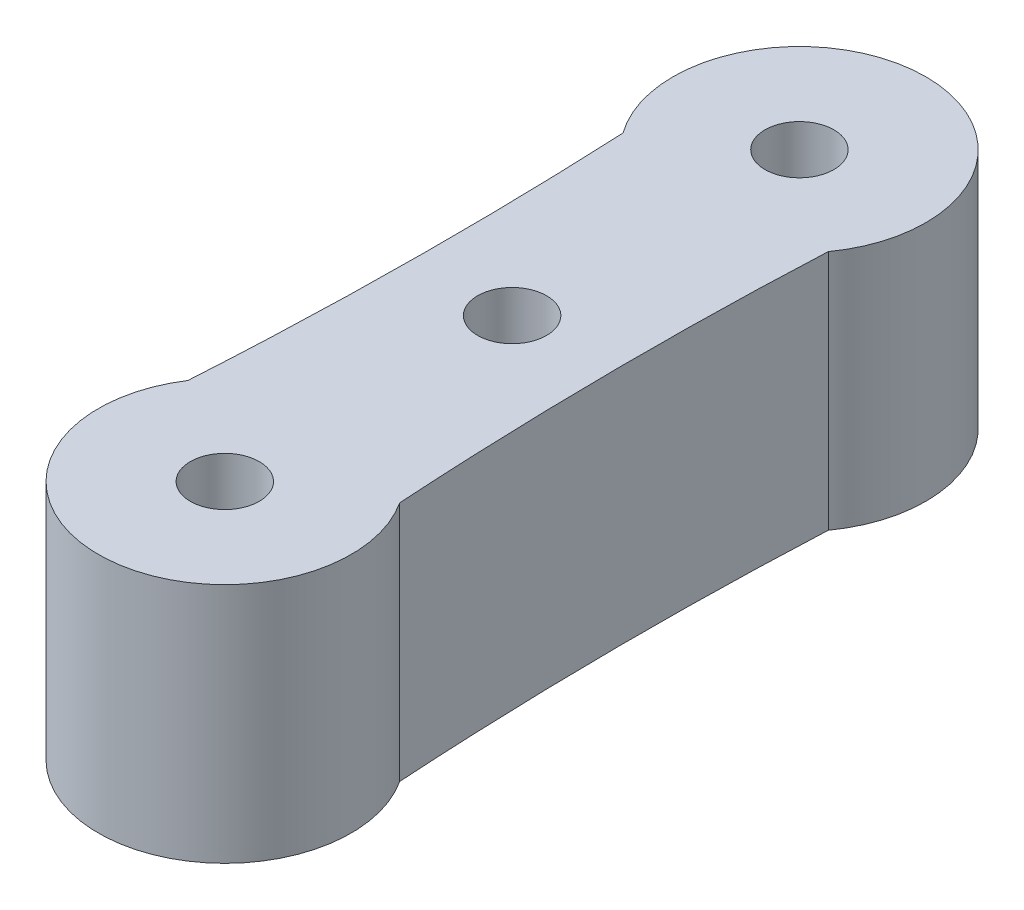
from build123d import *

# Parameters (mm, degrees)
SKETCH1_R           = 1.5
BOSS_EXTRUDE1_DEPTH = 10.5
SKETCH4_R           = 1.5
CUT_EXTRUDE1_DEPTH  = 13
SKETCH5_R           = 3
SKETCH5_R_2         = 1.5
CUT_EXTRUDE3_DEPTH  = 3.5


with BuildPart() as part:
    # Sketch1 → Boss-Extrude1 (new body)
    with BuildSketch(Plane(origin=(0, 0, 0), x_dir=(1, 0, 0), z_dir=(0, 1, 0))):
        with BuildLine():
            add(Edge.make_bspline(
                [(-4.46618649, 9.29014358), (-4.022251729, -0.107844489), (-4.608285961, -9.497717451)],
                knots=[0, 0, 0, 1, 1, 1], degree=2))
            ThreePointArc((-4.608285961, -9.497717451), (0, -18), (4.608285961, -9.497717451))
            add(Edge.make_bspline(
                [(4.46618649, 9.29014358), (4.022251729, -0.107844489), (4.608285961, -9.497717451)],
                knots=[0, 0, 0, 1, 1, 1], degree=2))
            ThreePointArc((4.46618649, 9.29014358), (0, 18), (-4.46618649, 9.29014358))
        make_face()
        with Locations(Location((0, -12.5, 0), (0, 0, 90))):
            Circle(SKETCH1_R, mode=Mode.SUBTRACT)
        with Locations(Location((0, 12.5, 0), (0, 0, 90))):
            Circle(SKETCH1_R, mode=Mode.SUBTRACT)
    extrude(amount=BOSS_EXTRUDE1_DEPTH)

    # Sketch4 → Cut-Extrude1 (cut)
    with BuildSketch(Plane.XZ):
        with Locations(Location((0, 0, 0), (0, 0, 270))):
            Circle(SKETCH4_R)
    extrude(amount=-CUT_EXTRUDE1_DEPTH, mode=Mode.SUBTRACT)

    # Sketch5 → Cut-Extrude3 (cut)
    # profile 1 of 3: a face of its own
    with BuildSketch(Plane.XZ):
        with Locations(Location((0, 12.5, 0), (0, 0, 270))):
            Circle(SKETCH5_R)
        with Locations(Location((0, 12.5, 0), (0, 0, 270))):
            Circle(SKETCH5_R_2, mode=Mode.SUBTRACT)
    # profile 2 of 3: a face of its own
    with BuildSketch(Plane.XZ):
        with Locations(Location((0, -12.5, 0), (0, 0, 270))):
            Circle(SKETCH5_R)
        with Locations(Location((0, -12.5, 0), (0, 0, 270))):
            Circle(SKETCH5_R_2, mode=Mode.SUBTRACT)
    # profile 3 of 3: a face of its own
    with BuildSketch(Plane.XZ):
        with Locations(Location((0, 0, 0), (0, 0, 270))):
            Circle(SKETCH5_R)
    extrude(amount=-CUT_EXTRUDE3_DEPTH, mode=Mode.SUBTRACT)


solid = part.part
